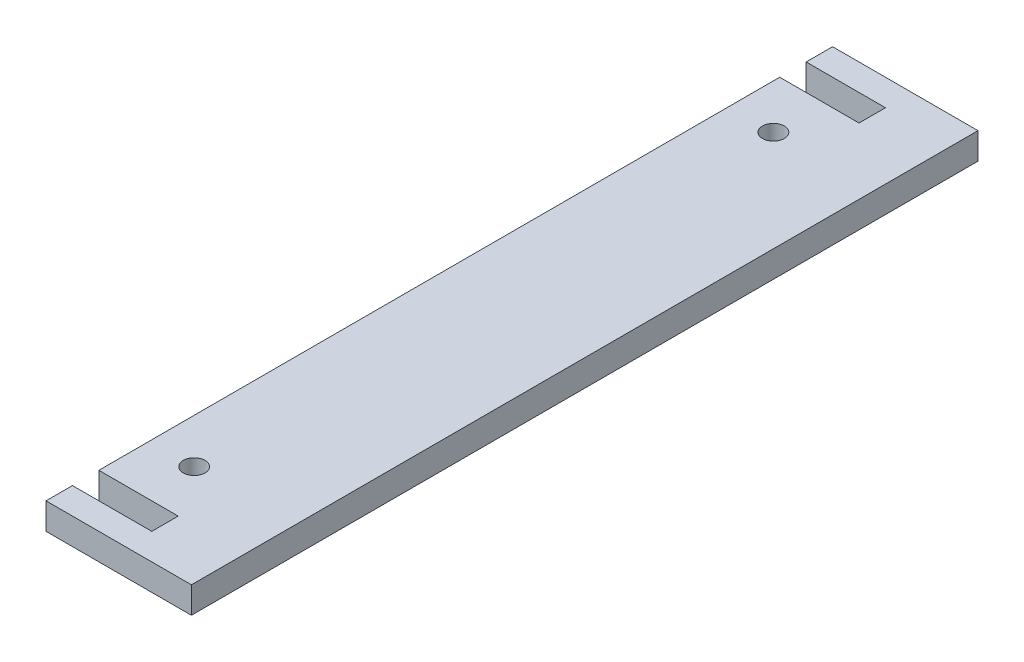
ISO-10303-21;
HEADER;
FILE_DESCRIPTION(('STEP AP214'),'2;1');
FILE_NAME('part.step','',(''),(''),'','','');
FILE_SCHEMA(('AUTOMOTIVE_DESIGN { 1 0 10303 214 1 1 1 1 }'));
ENDSEC;
DATA;
#1=APPLICATION_CONTEXT('core data for automotive mechanical design processes');
#2=APPLICATION_PROTOCOL_DEFINITION('international standard','automotive_design',2000,#1);
#3=PRODUCT_CONTEXT('',#1,'mechanical');
#4=PRODUCT('Part','Part','',(#3));
#5=PRODUCT_RELATED_PRODUCT_CATEGORY('part','',(#4));
#6=PRODUCT_DEFINITION_FORMATION('','',#4);
#7=PRODUCT_DEFINITION_CONTEXT('part definition',#1,'design');
#8=PRODUCT_DEFINITION('design','',#6,#7);
#9=PRODUCT_DEFINITION_SHAPE('','',#8);
#10=(LENGTH_UNIT() NAMED_UNIT(*) SI_UNIT(.MILLI.,.METRE.));
#11=(NAMED_UNIT(*) PLANE_ANGLE_UNIT() SI_UNIT($,.RADIAN.));
#12=(NAMED_UNIT(*) SI_UNIT($,.STERADIAN.) SOLID_ANGLE_UNIT());
#13=UNCERTAINTY_MEASURE_WITH_UNIT(LENGTH_MEASURE(1.E-05),#10,'distance_accuracy_value','');
#14=(GEOMETRIC_REPRESENTATION_CONTEXT(3) GLOBAL_UNCERTAINTY_ASSIGNED_CONTEXT((#13)) GLOBAL_UNIT_ASSIGNED_CONTEXT((#10,
#11,#12)) REPRESENTATION_CONTEXT('',''));
#15=CARTESIAN_POINT('',(0.,0.,0.));
#16=DIRECTION('',(0.,0.,1.));
#17=DIRECTION('',(1.,0.,0.));
#18=AXIS2_PLACEMENT_3D('',#15,#16,#17);
#19=CARTESIAN_POINT('',(11.,4.,-59.5));
#20=DIRECTION('',(0.,-1.,0.));
#21=DIRECTION('',(0.,0.,-1.));
#22=AXIS2_PLACEMENT_3D('',#19,#20,#21);
#23=PLANE('',#22);
#24=CARTESIAN_POINT('',(-4.27,4.,-43.815));
#25=DIRECTION('',(0.,1.,0.));
#26=DIRECTION('',(0.,0.,1.));
#27=AXIS2_PLACEMENT_3D('',#24,#25,#26);
#28=CIRCLE('',#27,1.65);
#29=CARTESIAN_POINT('',(-4.27,4.,-42.165));
#30=VERTEX_POINT('',#29);
#31=EDGE_CURVE('E156',#30,#30,#28,.T.);
#32=ORIENTED_EDGE('',*,*,#31,.F.);
#33=EDGE_LOOP('',(#32));
#34=FACE_BOUND('',#33,.T.);
#35=DIRECTION('',(0.,0.,-1.));
#36=VECTOR('',#35,1.);
#37=CARTESIAN_POINT('',(11.,4.,59.5));
#38=LINE('',#37,#36);
#39=CARTESIAN_POINT('',(11.,4.,59.5));
#40=VERTEX_POINT('',#39);
#41=CARTESIAN_POINT('',(11.,4.,-59.5));
#42=VERTEX_POINT('',#41);
#43=EDGE_CURVE('E175',#40,#42,#38,.T.);
#44=ORIENTED_EDGE('',*,*,#43,.T.);
#45=DIRECTION('',(-1.,0.,0.));
#46=VECTOR('',#45,1.);
#47=CARTESIAN_POINT('',(-11.,4.,-59.5));
#48=LINE('',#47,#46);
#49=CARTESIAN_POINT('',(-11.,4.,-59.5));
#50=VERTEX_POINT('',#49);
#51=EDGE_CURVE('E103',#42,#50,#48,.T.);
#52=ORIENTED_EDGE('',*,*,#51,.T.);
#53=DIRECTION('',(0.,0.,1.));
#54=VECTOR('',#53,1.);
#55=CARTESIAN_POINT('',(-11.,4.,-55.5));
#56=LINE('',#55,#54);
#57=CARTESIAN_POINT('',(-11.,4.,-55.5));
#58=VERTEX_POINT('',#57);
#59=EDGE_CURVE('E202',#50,#58,#56,.T.);
#60=ORIENTED_EDGE('',*,*,#59,.T.);
#61=DIRECTION('',(1.,0.,0.));
#62=VECTOR('',#61,1.);
#63=CARTESIAN_POINT('',(-11.,4.,-55.5));
#64=LINE('',#63,#62);
#65=CARTESIAN_POINT('',(1.,4.,-55.5));
#66=VERTEX_POINT('',#65);
#67=EDGE_CURVE('E221',#58,#66,#64,.T.);
#68=ORIENTED_EDGE('',*,*,#67,.T.);
#69=DIRECTION('',(0.,0.,1.));
#70=VECTOR('',#69,1.);
#71=CARTESIAN_POINT('',(1.,4.,-55.5));
#72=LINE('',#71,#70);
#73=CARTESIAN_POINT('',(1.,4.,-51.5));
#74=VERTEX_POINT('',#73);
#75=EDGE_CURVE('E218',#66,#74,#72,.T.);
#76=ORIENTED_EDGE('',*,*,#75,.T.);
#77=DIRECTION('',(-1.,0.,0.));
#78=VECTOR('',#77,1.);
#79=CARTESIAN_POINT('',(-11.,4.,-51.5));
#80=LINE('',#79,#78);
#81=CARTESIAN_POINT('',(-11.,4.,-51.5));
#82=VERTEX_POINT('',#81);
#83=EDGE_CURVE('E220',#74,#82,#80,.T.);
#84=ORIENTED_EDGE('',*,*,#83,.T.);
#85=DIRECTION('',(0.,0.,1.));
#86=VECTOR('',#85,1.);
#87=CARTESIAN_POINT('',(-11.,4.,51.5));
#88=LINE('',#87,#86);
#89=CARTESIAN_POINT('',(-11.,4.,51.5));
#90=VERTEX_POINT('',#89);
#91=EDGE_CURVE('E223',#82,#90,#88,.T.);
#92=ORIENTED_EDGE('',*,*,#91,.T.);
#93=DIRECTION('',(1.,0.,0.));
#94=VECTOR('',#93,1.);
#95=CARTESIAN_POINT('',(-11.,4.,51.5));
#96=LINE('',#95,#94);
#97=CARTESIAN_POINT('',(1.,4.,51.5));
#98=VERTEX_POINT('',#97);
#99=EDGE_CURVE('E229',#90,#98,#96,.T.);
#100=ORIENTED_EDGE('',*,*,#99,.T.);
#101=DIRECTION('',(0.,0.,1.));
#102=VECTOR('',#101,1.);
#103=CARTESIAN_POINT('',(1.,4.,55.5));
#104=LINE('',#103,#102);
#105=CARTESIAN_POINT('',(1.,4.,55.5));
#106=VERTEX_POINT('',#105);
#107=EDGE_CURVE('E134',#98,#106,#104,.T.);
#108=ORIENTED_EDGE('',*,*,#107,.T.);
#109=DIRECTION('',(-1.,0.,0.));
#110=VECTOR('',#109,1.);
#111=CARTESIAN_POINT('',(-11.,4.,55.5));
#112=LINE('',#111,#110);
#113=CARTESIAN_POINT('',(-11.,4.,55.5));
#114=VERTEX_POINT('',#113);
#115=EDGE_CURVE('E128',#106,#114,#112,.T.);
#116=ORIENTED_EDGE('',*,*,#115,.T.);
#117=DIRECTION('',(0.,0.,1.));
#118=VECTOR('',#117,1.);
#119=CARTESIAN_POINT('',(-11.,4.,59.5));
#120=LINE('',#119,#118);
#121=CARTESIAN_POINT('',(-11.,4.,59.5));
#122=VERTEX_POINT('',#121);
#123=EDGE_CURVE('E132',#114,#122,#120,.T.);
#124=ORIENTED_EDGE('',*,*,#123,.T.);
#125=DIRECTION('',(1.,0.,0.));
#126=VECTOR('',#125,1.);
#127=CARTESIAN_POINT('',(-11.,4.,59.5));
#128=LINE('',#127,#126);
#129=EDGE_CURVE('E48',#122,#40,#128,.T.);
#130=ORIENTED_EDGE('',*,*,#129,.T.);
#131=EDGE_LOOP('',(#44,#52,#60,#68,#76,#84,#92,#100,#108,#116,#124,#130));
#132=FACE_BOUND('',#131,.T.);
#133=CARTESIAN_POINT('',(-4.27,4.,43.815));
#134=DIRECTION('',(0.,1.,0.));
#135=DIRECTION('',(0.,0.,1.));
#136=AXIS2_PLACEMENT_3D('',#133,#134,#135);
#137=CIRCLE('',#136,1.65);
#138=CARTESIAN_POINT('',(-4.27,4.,45.465));
#139=VERTEX_POINT('',#138);
#140=EDGE_CURVE('E272',#139,#139,#137,.T.);
#141=ORIENTED_EDGE('',*,*,#140,.F.);
#142=EDGE_LOOP('',(#141));
#143=FACE_BOUND('',#142,.T.);
#144=ADVANCED_FACE('F31',(#34,#132,#143),#23,.F.);
#145=CARTESIAN_POINT('',(11.,0.,-59.5));
#146=DIRECTION('',(0.,-1.,0.));
#147=DIRECTION('',(0.,0.,-1.));
#148=AXIS2_PLACEMENT_3D('',#145,#146,#147);
#149=PLANE('',#148);
#150=CARTESIAN_POINT('',(-4.27,0.,-43.815));
#151=DIRECTION('',(0.,1.,0.));
#152=DIRECTION('',(0.,0.,1.));
#153=AXIS2_PLACEMENT_3D('',#150,#151,#152);
#154=CIRCLE('',#153,1.65);
#155=CARTESIAN_POINT('',(-4.27,0.,-42.165));
#156=VERTEX_POINT('',#155);
#157=EDGE_CURVE('E277',#156,#156,#154,.T.);
#158=ORIENTED_EDGE('',*,*,#157,.T.);
#159=EDGE_LOOP('',(#158));
#160=FACE_BOUND('',#159,.T.);
#161=DIRECTION('',(0.,0.,-1.));
#162=VECTOR('',#161,1.);
#163=CARTESIAN_POINT('',(11.,0.,59.5));
#164=LINE('',#163,#162);
#165=CARTESIAN_POINT('',(11.,0.,59.5));
#166=VERTEX_POINT('',#165);
#167=CARTESIAN_POINT('',(11.,0.,-59.5));
#168=VERTEX_POINT('',#167);
#169=EDGE_CURVE('E152',#166,#168,#164,.T.);
#170=ORIENTED_EDGE('',*,*,#169,.F.);
#171=DIRECTION('',(1.,0.,0.));
#172=VECTOR('',#171,1.);
#173=CARTESIAN_POINT('',(-11.,0.,59.5));
#174=LINE('',#173,#172);
#175=CARTESIAN_POINT('',(-11.,0.,59.5));
#176=VERTEX_POINT('',#175);
#177=EDGE_CURVE('E95',#176,#166,#174,.T.);
#178=ORIENTED_EDGE('',*,*,#177,.F.);
#179=DIRECTION('',(0.,0.,1.));
#180=VECTOR('',#179,1.);
#181=CARTESIAN_POINT('',(-11.,0.,59.5));
#182=LINE('',#181,#180);
#183=CARTESIAN_POINT('',(-11.,0.,55.5));
#184=VERTEX_POINT('',#183);
#185=EDGE_CURVE('E89',#184,#176,#182,.T.);
#186=ORIENTED_EDGE('',*,*,#185,.F.);
#187=DIRECTION('',(-1.,0.,0.));
#188=VECTOR('',#187,1.);
#189=CARTESIAN_POINT('',(-11.,0.,55.5));
#190=LINE('',#189,#188);
#191=CARTESIAN_POINT('',(1.,0.,55.5));
#192=VERTEX_POINT('',#191);
#193=EDGE_CURVE('E142',#192,#184,#190,.T.);
#194=ORIENTED_EDGE('',*,*,#193,.F.);
#195=DIRECTION('',(0.,0.,1.));
#196=VECTOR('',#195,1.);
#197=CARTESIAN_POINT('',(1.,0.,55.5));
#198=LINE('',#197,#196);
#199=CARTESIAN_POINT('',(1.,0.,51.5));
#200=VERTEX_POINT('',#199);
#201=EDGE_CURVE('E170',#200,#192,#198,.T.);
#202=ORIENTED_EDGE('',*,*,#201,.F.);
#203=DIRECTION('',(1.,0.,0.));
#204=VECTOR('',#203,1.);
#205=CARTESIAN_POINT('',(-11.,0.,51.5));
#206=LINE('',#205,#204);
#207=CARTESIAN_POINT('',(-11.,0.,51.5));
#208=VERTEX_POINT('',#207);
#209=EDGE_CURVE('E168',#208,#200,#206,.T.);
#210=ORIENTED_EDGE('',*,*,#209,.F.);
#211=DIRECTION('',(0.,0.,1.));
#212=VECTOR('',#211,1.);
#213=CARTESIAN_POINT('',(-11.,0.,51.5));
#214=LINE('',#213,#212);
#215=CARTESIAN_POINT('',(-11.,0.,-51.5));
#216=VERTEX_POINT('',#215);
#217=EDGE_CURVE('E166',#216,#208,#214,.T.);
#218=ORIENTED_EDGE('',*,*,#217,.F.);
#219=DIRECTION('',(-1.,0.,0.));
#220=VECTOR('',#219,1.);
#221=CARTESIAN_POINT('',(-11.,0.,-51.5));
#222=LINE('',#221,#220);
#223=CARTESIAN_POINT('',(1.,0.,-51.5));
#224=VERTEX_POINT('',#223);
#225=EDGE_CURVE('E164',#224,#216,#222,.T.);
#226=ORIENTED_EDGE('',*,*,#225,.F.);
#227=DIRECTION('',(0.,0.,1.));
#228=VECTOR('',#227,1.);
#229=CARTESIAN_POINT('',(1.,0.,-55.5));
#230=LINE('',#229,#228);
#231=CARTESIAN_POINT('',(1.,0.,-55.5));
#232=VERTEX_POINT('',#231);
#233=EDGE_CURVE('E162',#232,#224,#230,.T.);
#234=ORIENTED_EDGE('',*,*,#233,.F.);
#235=DIRECTION('',(1.,0.,0.));
#236=VECTOR('',#235,1.);
#237=CARTESIAN_POINT('',(-11.,0.,-55.5));
#238=LINE('',#237,#236);
#239=CARTESIAN_POINT('',(-11.,0.,-55.5));
#240=VERTEX_POINT('',#239);
#241=EDGE_CURVE('E160',#240,#232,#238,.T.);
#242=ORIENTED_EDGE('',*,*,#241,.F.);
#243=DIRECTION('',(0.,0.,1.));
#244=VECTOR('',#243,1.);
#245=CARTESIAN_POINT('',(-11.,0.,-55.5));
#246=LINE('',#245,#244);
#247=CARTESIAN_POINT('',(-11.,0.,-59.5));
#248=VERTEX_POINT('',#247);
#249=EDGE_CURVE('E158',#248,#240,#246,.T.);
#250=ORIENTED_EDGE('',*,*,#249,.F.);
#251=DIRECTION('',(-1.,0.,0.));
#252=VECTOR('',#251,1.);
#253=CARTESIAN_POINT('',(-11.,0.,-59.5));
#254=LINE('',#253,#252);
#255=EDGE_CURVE('E155',#168,#248,#254,.T.);
#256=ORIENTED_EDGE('',*,*,#255,.F.);
#257=EDGE_LOOP('',(#170,#178,#186,#194,#202,#210,#218,#226,#234,#242,#250,#256));
#258=FACE_BOUND('',#257,.T.);
#259=CARTESIAN_POINT('',(-4.27,0.,43.815));
#260=DIRECTION('',(0.,1.,0.));
#261=DIRECTION('',(0.,0.,1.));
#262=AXIS2_PLACEMENT_3D('',#259,#260,#261);
#263=CIRCLE('',#262,1.65);
#264=CARTESIAN_POINT('',(-4.27,0.,45.465));
#265=VERTEX_POINT('',#264);
#266=EDGE_CURVE('E275',#265,#265,#263,.T.);
#267=ORIENTED_EDGE('',*,*,#266,.T.);
#268=EDGE_LOOP('',(#267));
#269=FACE_BOUND('',#268,.T.);
#270=ADVANCED_FACE('F206',(#160,#258,#269),#149,.T.);
#271=CARTESIAN_POINT('',(11.,4.,59.5));
#272=DIRECTION('',(-1.,0.,0.));
#273=DIRECTION('',(0.,0.,1.));
#274=AXIS2_PLACEMENT_3D('',#271,#272,#273);
#275=PLANE('',#274);
#276=ORIENTED_EDGE('',*,*,#169,.T.);
#277=DIRECTION('',(0.,-1.,0.));
#278=VECTOR('',#277,1.);
#279=CARTESIAN_POINT('',(11.,4.,-59.5));
#280=LINE('',#279,#278);
#281=EDGE_CURVE('E11',#42,#168,#280,.T.);
#282=ORIENTED_EDGE('',*,*,#281,.F.);
#283=ORIENTED_EDGE('',*,*,#43,.F.);
#284=DIRECTION('',(0.,-1.,0.));
#285=VECTOR('',#284,1.);
#286=CARTESIAN_POINT('',(11.,4.,59.5));
#287=LINE('',#286,#285);
#288=EDGE_CURVE('E148',#40,#166,#287,.T.);
#289=ORIENTED_EDGE('',*,*,#288,.T.);
#290=EDGE_LOOP('',(#276,#282,#283,#289));
#291=FACE_BOUND('',#290,.T.);
#292=ADVANCED_FACE('F33',(#291),#275,.F.);
#293=CARTESIAN_POINT('',(-11.,4.,-59.5));
#294=DIRECTION('',(0.,0.,1.));
#295=DIRECTION('',(1.,0.,0.));
#296=AXIS2_PLACEMENT_3D('',#293,#294,#295);
#297=PLANE('',#296);
#298=ORIENTED_EDGE('',*,*,#255,.T.);
#299=DIRECTION('',(0.,-1.,0.));
#300=VECTOR('',#299,1.);
#301=CARTESIAN_POINT('',(-11.,4.,-59.5));
#302=LINE('',#301,#300);
#303=EDGE_CURVE('E40',#50,#248,#302,.T.);
#304=ORIENTED_EDGE('',*,*,#303,.F.);
#305=ORIENTED_EDGE('',*,*,#51,.F.);
#306=ORIENTED_EDGE('',*,*,#281,.T.);
#307=EDGE_LOOP('',(#298,#304,#305,#306));
#308=FACE_BOUND('',#307,.T.);
#309=ADVANCED_FACE('F370',(#308),#297,.F.);
#310=CARTESIAN_POINT('',(-11.,4.,-55.5));
#311=DIRECTION('',(1.,0.,0.));
#312=DIRECTION('',(0.,0.,-1.));
#313=AXIS2_PLACEMENT_3D('',#310,#311,#312);
#314=PLANE('',#313);
#315=ORIENTED_EDGE('',*,*,#249,.T.);
#316=DIRECTION('',(0.,-1.,0.));
#317=VECTOR('',#316,1.);
#318=CARTESIAN_POINT('',(-11.,4.,-55.5));
#319=LINE('',#318,#317);
#320=EDGE_CURVE('E194',#58,#240,#319,.T.);
#321=ORIENTED_EDGE('',*,*,#320,.F.);
#322=ORIENTED_EDGE('',*,*,#59,.F.);
#323=ORIENTED_EDGE('',*,*,#303,.T.);
#324=EDGE_LOOP('',(#315,#321,#322,#323));
#325=FACE_BOUND('',#324,.T.);
#326=ADVANCED_FACE('F200',(#325),#314,.F.);
#327=CARTESIAN_POINT('',(-11.,4.,-55.5));
#328=DIRECTION('',(0.,0.,-1.));
#329=DIRECTION('',(-1.,0.,0.));
#330=AXIS2_PLACEMENT_3D('',#327,#328,#329);
#331=PLANE('',#330);
#332=ORIENTED_EDGE('',*,*,#241,.T.);
#333=DIRECTION('',(0.,-1.,0.));
#334=VECTOR('',#333,1.);
#335=CARTESIAN_POINT('',(1.,4.,-55.5));
#336=LINE('',#335,#334);
#337=EDGE_CURVE('E191',#66,#232,#336,.T.);
#338=ORIENTED_EDGE('',*,*,#337,.F.);
#339=ORIENTED_EDGE('',*,*,#67,.F.);
#340=ORIENTED_EDGE('',*,*,#320,.T.);
#341=EDGE_LOOP('',(#332,#338,#339,#340));
#342=FACE_BOUND('',#341,.T.);
#343=ADVANCED_FACE('F212',(#342),#331,.F.);
#344=CARTESIAN_POINT('',(1.,4.,-55.5));
#345=DIRECTION('',(1.,0.,0.));
#346=DIRECTION('',(0.,0.,-1.));
#347=AXIS2_PLACEMENT_3D('',#344,#345,#346);
#348=PLANE('',#347);
#349=ORIENTED_EDGE('',*,*,#233,.T.);
#350=DIRECTION('',(0.,-1.,0.));
#351=VECTOR('',#350,1.);
#352=CARTESIAN_POINT('',(1.,4.,-51.5));
#353=LINE('',#352,#351);
#354=EDGE_CURVE('E188',#74,#224,#353,.T.);
#355=ORIENTED_EDGE('',*,*,#354,.F.);
#356=ORIENTED_EDGE('',*,*,#75,.F.);
#357=ORIENTED_EDGE('',*,*,#337,.T.);
#358=EDGE_LOOP('',(#349,#355,#356,#357));
#359=FACE_BOUND('',#358,.T.);
#360=ADVANCED_FACE('F216',(#359),#348,.F.);
#361=CARTESIAN_POINT('',(-11.,4.,-51.5));
#362=DIRECTION('',(0.,0.,1.));
#363=DIRECTION('',(1.,0.,0.));
#364=AXIS2_PLACEMENT_3D('',#361,#362,#363);
#365=PLANE('',#364);
#366=ORIENTED_EDGE('',*,*,#225,.T.);
#367=DIRECTION('',(0.,-1.,0.));
#368=VECTOR('',#367,1.);
#369=CARTESIAN_POINT('',(-11.,4.,-51.5));
#370=LINE('',#369,#368);
#371=EDGE_CURVE('E185',#82,#216,#370,.T.);
#372=ORIENTED_EDGE('',*,*,#371,.F.);
#373=ORIENTED_EDGE('',*,*,#83,.F.);
#374=ORIENTED_EDGE('',*,*,#354,.T.);
#375=EDGE_LOOP('',(#366,#372,#373,#374));
#376=FACE_BOUND('',#375,.T.);
#377=ADVANCED_FACE('F335',(#376),#365,.F.);
#378=CARTESIAN_POINT('',(-11.,4.,51.5));
#379=DIRECTION('',(1.,0.,0.));
#380=DIRECTION('',(0.,0.,-1.));
#381=AXIS2_PLACEMENT_3D('',#378,#379,#380);
#382=PLANE('',#381);
#383=ORIENTED_EDGE('',*,*,#217,.T.);
#384=DIRECTION('',(0.,-1.,0.));
#385=VECTOR('',#384,1.);
#386=CARTESIAN_POINT('',(-11.,4.,51.5));
#387=LINE('',#386,#385);
#388=EDGE_CURVE('E182',#90,#208,#387,.T.);
#389=ORIENTED_EDGE('',*,*,#388,.F.);
#390=ORIENTED_EDGE('',*,*,#91,.F.);
#391=ORIENTED_EDGE('',*,*,#371,.T.);
#392=EDGE_LOOP('',(#383,#389,#390,#391));
#393=FACE_BOUND('',#392,.T.);
#394=ADVANCED_FACE('F326',(#393),#382,.F.);
#395=CARTESIAN_POINT('',(-11.,4.,51.5));
#396=DIRECTION('',(0.,0.,-1.));
#397=DIRECTION('',(-1.,0.,0.));
#398=AXIS2_PLACEMENT_3D('',#395,#396,#397);
#399=PLANE('',#398);
#400=ORIENTED_EDGE('',*,*,#209,.T.);
#401=DIRECTION('',(0.,-1.,0.));
#402=VECTOR('',#401,1.);
#403=CARTESIAN_POINT('',(1.,4.,51.5));
#404=LINE('',#403,#402);
#405=EDGE_CURVE('E179',#98,#200,#404,.T.);
#406=ORIENTED_EDGE('',*,*,#405,.F.);
#407=ORIENTED_EDGE('',*,*,#99,.F.);
#408=ORIENTED_EDGE('',*,*,#388,.T.);
#409=EDGE_LOOP('',(#400,#406,#407,#408));
#410=FACE_BOUND('',#409,.T.);
#411=ADVANCED_FACE('F235',(#410),#399,.F.);
#412=CARTESIAN_POINT('',(1.,4.,55.5));
#413=DIRECTION('',(1.,0.,0.));
#414=DIRECTION('',(0.,0.,-1.));
#415=AXIS2_PLACEMENT_3D('',#412,#413,#414);
#416=PLANE('',#415);
#417=ORIENTED_EDGE('',*,*,#201,.T.);
#418=DIRECTION('',(0.,-1.,0.));
#419=VECTOR('',#418,1.);
#420=CARTESIAN_POINT('',(1.,4.,55.5));
#421=LINE('',#420,#419);
#422=EDGE_CURVE('E143',#106,#192,#421,.T.);
#423=ORIENTED_EDGE('',*,*,#422,.F.);
#424=ORIENTED_EDGE('',*,*,#107,.F.);
#425=ORIENTED_EDGE('',*,*,#405,.T.);
#426=EDGE_LOOP('',(#417,#423,#424,#425));
#427=FACE_BOUND('',#426,.T.);
#428=ADVANCED_FACE('F239',(#427),#416,.F.);
#429=CARTESIAN_POINT('',(-11.,4.,55.5));
#430=DIRECTION('',(0.,0.,1.));
#431=DIRECTION('',(1.,0.,0.));
#432=AXIS2_PLACEMENT_3D('',#429,#430,#431);
#433=PLANE('',#432);
#434=ORIENTED_EDGE('',*,*,#193,.T.);
#435=DIRECTION('',(0.,-1.,0.));
#436=VECTOR('',#435,1.);
#437=CARTESIAN_POINT('',(-11.,4.,55.5));
#438=LINE('',#437,#436);
#439=EDGE_CURVE('E139',#114,#184,#438,.T.);
#440=ORIENTED_EDGE('',*,*,#439,.F.);
#441=ORIENTED_EDGE('',*,*,#115,.F.);
#442=ORIENTED_EDGE('',*,*,#422,.T.);
#443=EDGE_LOOP('',(#434,#440,#441,#442));
#444=FACE_BOUND('',#443,.T.);
#445=ADVANCED_FACE('F140',(#444),#433,.F.);
#446=CARTESIAN_POINT('',(-11.,4.,59.5));
#447=DIRECTION('',(1.,0.,0.));
#448=DIRECTION('',(0.,0.,-1.));
#449=AXIS2_PLACEMENT_3D('',#446,#447,#448);
#450=PLANE('',#449);
#451=ORIENTED_EDGE('',*,*,#185,.T.);
#452=DIRECTION('',(0.,-1.,0.));
#453=VECTOR('',#452,1.);
#454=CARTESIAN_POINT('',(-11.,4.,59.5));
#455=LINE('',#454,#453);
#456=EDGE_CURVE('E144',#122,#176,#455,.T.);
#457=ORIENTED_EDGE('',*,*,#456,.F.);
#458=ORIENTED_EDGE('',*,*,#123,.F.);
#459=ORIENTED_EDGE('',*,*,#439,.T.);
#460=EDGE_LOOP('',(#451,#457,#458,#459));
#461=FACE_BOUND('',#460,.T.);
#462=ADVANCED_FACE('F146',(#461),#450,.F.);
#463=CARTESIAN_POINT('',(-11.,4.,59.5));
#464=DIRECTION('',(0.,0.,-1.));
#465=DIRECTION('',(-1.,0.,0.));
#466=AXIS2_PLACEMENT_3D('',#463,#464,#465);
#467=PLANE('',#466);
#468=ORIENTED_EDGE('',*,*,#177,.T.);
#469=ORIENTED_EDGE('',*,*,#288,.F.);
#470=ORIENTED_EDGE('',*,*,#129,.F.);
#471=ORIENTED_EDGE('',*,*,#456,.T.);
#472=EDGE_LOOP('',(#468,#469,#470,#471));
#473=FACE_BOUND('',#472,.T.);
#474=ADVANCED_FACE('F243',(#473),#467,.F.);
#475=CARTESIAN_POINT('',(-4.27,4.,-43.815));
#476=DIRECTION('',(0.,-1.,0.));
#477=DIRECTION('',(0.,0.,-1.));
#478=AXIS2_PLACEMENT_3D('',#475,#476,#477);
#479=CYLINDRICAL_SURFACE('',#478,1.65);
#480=ORIENTED_EDGE('',*,*,#31,.T.);
#481=EDGE_LOOP('',(#480));
#482=FACE_BOUND('',#481,.T.);
#483=ORIENTED_EDGE('',*,*,#157,.F.);
#484=EDGE_LOOP('',(#483));
#485=FACE_BOUND('',#484,.T.);
#486=ADVANCED_FACE('F245',(#482,#485),#479,.F.);
#487=CARTESIAN_POINT('',(-4.27,4.,43.815));
#488=DIRECTION('',(0.,-1.,0.));
#489=DIRECTION('',(0.,0.,-1.));
#490=AXIS2_PLACEMENT_3D('',#487,#488,#489);
#491=CYLINDRICAL_SURFACE('',#490,1.65);
#492=ORIENTED_EDGE('',*,*,#140,.T.);
#493=EDGE_LOOP('',(#492));
#494=FACE_BOUND('',#493,.T.);
#495=ORIENTED_EDGE('',*,*,#266,.F.);
#496=EDGE_LOOP('',(#495));
#497=FACE_BOUND('',#496,.T.);
#498=ADVANCED_FACE('F251',(#494,#497),#491,.F.);
#499=CLOSED_SHELL('',(#144,#270,#292,#309,#326,#343,#360,#377,#394,#411,#428,#445,#462,#474,
#486,#498));
#500=MANIFOLD_SOLID_BREP('B2',#499);
#501=ADVANCED_BREP_SHAPE_REPRESENTATION('',(#18,#500),#14);
#502=SHAPE_DEFINITION_REPRESENTATION(#9,#501);
ENDSEC;
END-ISO-10303-21;
